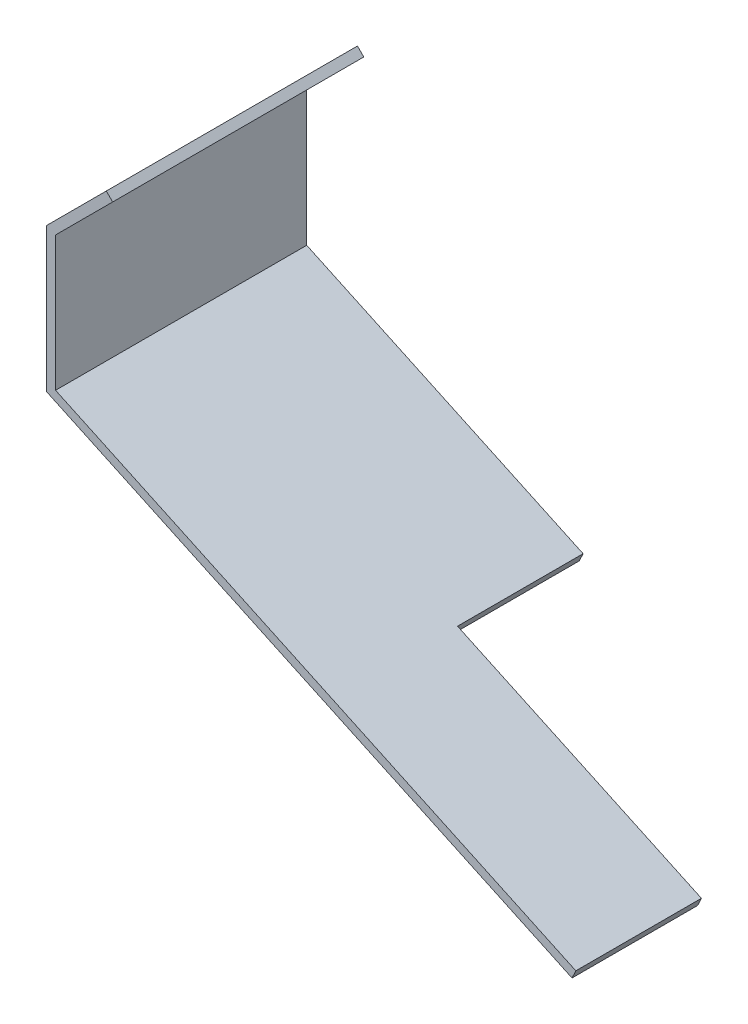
from build123d import *

# Parameters (mm, degrees)
EXTRU_MINCE1_DEPTH      = 70
ESQUISSE2_W             = 150
ESQUISSE2_H             = 70
ENL_V_MAT_EXTRU_1_DEPTH = 10


with BuildPart() as part:
    # Esquisse1 → Extru.-Mince1 (new, symmetric)
    with BuildSketch(Plane.XY):
        Polygon((290.018491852, -135.237843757), (0, 0), (0, 75), (31.819805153, 106.819805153), (28.284271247, 110.355339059), (-5, 77.071067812), (-5, -3.185351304), (287.905400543, -139.769382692), align=None)
    extrude(amount=EXTRU_MINCE1_DEPTH, both=True)

    # Esquisse2 → Enl_v. mat.-Extru.1 (cut)
    with BuildSketch(Plane(origin=(-2.113091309, -4.531538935, 0), x_dir=(0.9063077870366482, -0.42261826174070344, 0), z_dir=(-0.4226182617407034, -0.906307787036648, 0))):
        with Locations((245, -35)):
            Rectangle(ESQUISSE2_W, ESQUISSE2_H)
    extrude(amount=-ENL_V_MAT_EXTRU_1_DEPTH, mode=Mode.SUBTRACT)


solid = part.part
